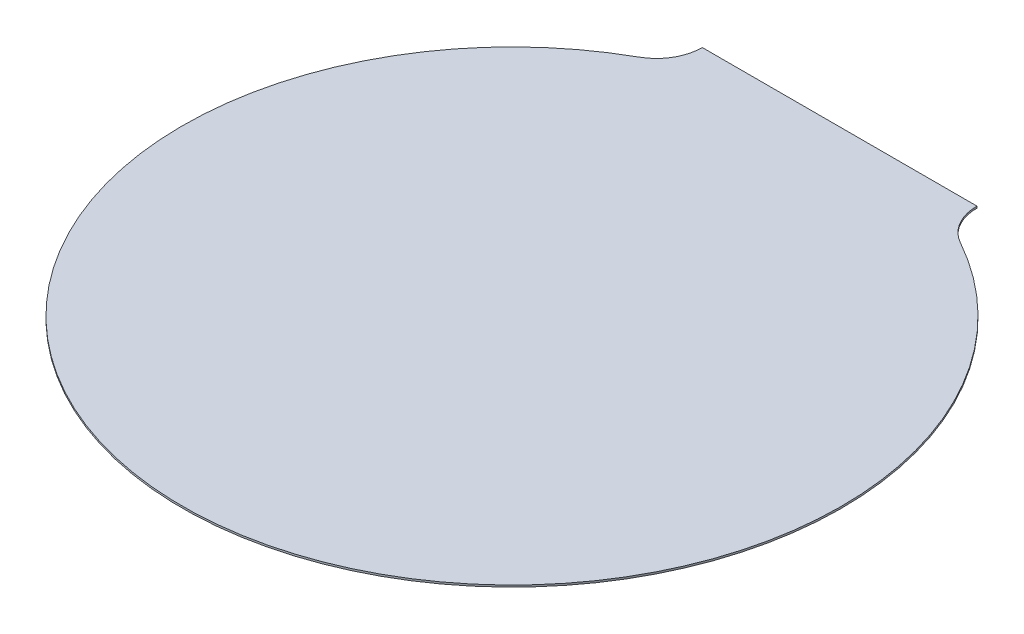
ISO-10303-21;
HEADER;
FILE_DESCRIPTION(('STEP AP214'),'2;1');
FILE_NAME('part.step','',(''),(''),'','','');
FILE_SCHEMA(('AUTOMOTIVE_DESIGN { 1 0 10303 214 1 1 1 1 }'));
ENDSEC;
DATA;
#1=APPLICATION_CONTEXT('core data for automotive mechanical design processes');
#2=APPLICATION_PROTOCOL_DEFINITION('international standard','automotive_design',2000,#1);
#3=PRODUCT_CONTEXT('',#1,'mechanical');
#4=PRODUCT('Part','Part','',(#3));
#5=PRODUCT_RELATED_PRODUCT_CATEGORY('part','',(#4));
#6=PRODUCT_DEFINITION_FORMATION('','',#4);
#7=PRODUCT_DEFINITION_CONTEXT('part definition',#1,'design');
#8=PRODUCT_DEFINITION('design','',#6,#7);
#9=PRODUCT_DEFINITION_SHAPE('','',#8);
#10=(LENGTH_UNIT() NAMED_UNIT(*) SI_UNIT(.MILLI.,.METRE.));
#11=(NAMED_UNIT(*) PLANE_ANGLE_UNIT() SI_UNIT($,.RADIAN.));
#12=(NAMED_UNIT(*) SI_UNIT($,.STERADIAN.) SOLID_ANGLE_UNIT());
#13=UNCERTAINTY_MEASURE_WITH_UNIT(LENGTH_MEASURE(1.E-05),#10,'distance_accuracy_value','');
#14=(GEOMETRIC_REPRESENTATION_CONTEXT(3) GLOBAL_UNCERTAINTY_ASSIGNED_CONTEXT((#13)) GLOBAL_UNIT_ASSIGNED_CONTEXT((#10,
#11,#12)) REPRESENTATION_CONTEXT('',''));
#15=CARTESIAN_POINT('',(0.,0.,0.));
#16=DIRECTION('',(0.,0.,1.));
#17=DIRECTION('',(1.,0.,0.));
#18=AXIS2_PLACEMENT_3D('',#15,#16,#17);
#19=CARTESIAN_POINT('',(-5.07969240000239,0.0508,-9.09110120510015));
#20=DIRECTION('',(0.,-1.,0.));
#21=DIRECTION('',(0.,0.,-1.));
#22=AXIS2_PLACEMENT_3D('',#19,#20,#21);
#23=CYLINDRICAL_SURFACE('',#22,1.27000000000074);
#24=CARTESIAN_POINT('',(-5.07969240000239,0.,-9.09110120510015));
#25=DIRECTION('',(0.,-1.,0.));
#26=DIRECTION('',(0.,0.,1.));
#27=AXIS2_PLACEMENT_3D('',#24,#25,#26);
#28=CIRCLE('',#27,1.27000000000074);
#29=CARTESIAN_POINT('',(-3.80969240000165,0.,-9.09110120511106));
#30=VERTEX_POINT('',#29);
#31=CARTESIAN_POINT('',(-4.46021771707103,0.,-7.98243032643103));
#32=VERTEX_POINT('',#31);
#33=EDGE_CURVE('E93',#30,#32,#28,.T.);
#34=ORIENTED_EDGE('',*,*,#33,.T.);
#35=DIRECTION('',(0.,-1.,0.));
#36=VECTOR('',#35,1.);
#37=CARTESIAN_POINT('',(-4.46021771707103,0.0508,-7.98243032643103));
#38=LINE('',#37,#36);
#39=CARTESIAN_POINT('',(-4.46021771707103,0.0508,-7.98243032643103));
#40=VERTEX_POINT('',#39);
#41=EDGE_CURVE('E11',#40,#32,#38,.T.);
#42=ORIENTED_EDGE('',*,*,#41,.F.);
#43=CARTESIAN_POINT('',(-5.07969240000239,0.0508,-9.09110120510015));
#44=DIRECTION('',(0.,-1.,0.));
#45=DIRECTION('',(0.,0.,1.));
#46=AXIS2_PLACEMENT_3D('',#43,#44,#45);
#47=CIRCLE('',#46,1.27000000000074);
#48=CARTESIAN_POINT('',(-3.80969240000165,0.0508,-9.09110120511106));
#49=VERTEX_POINT('',#48);
#50=EDGE_CURVE('E81',#49,#40,#47,.T.);
#51=ORIENTED_EDGE('',*,*,#50,.F.);
#52=DIRECTION('',(0.,-1.,0.));
#53=VECTOR('',#52,1.);
#54=CARTESIAN_POINT('',(-3.80969240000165,0.0508,-9.09110120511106));
#55=LINE('',#54,#53);
#56=EDGE_CURVE('E89',#49,#30,#55,.T.);
#57=ORIENTED_EDGE('',*,*,#56,.T.);
#58=EDGE_LOOP('',(#34,#42,#51,#57));
#59=FACE_BOUND('',#58,.T.);
#60=ADVANCED_FACE('F30',(#59),#23,.F.);
#61=CARTESIAN_POINT('',(0.,0.0508,0.));
#62=DIRECTION('',(0.,-1.,0.));
#63=DIRECTION('',(0.,0.,-1.));
#64=AXIS2_PLACEMENT_3D('',#61,#62,#63);
#65=CYLINDRICAL_SURFACE('',#64,9.14400000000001);
#66=CARTESIAN_POINT('',(0.,0.,0.));
#67=DIRECTION('',(0.,1.,0.));
#68=DIRECTION('',(0.,0.,1.));
#69=AXIS2_PLACEMENT_3D('',#66,#67,#68);
#70=CIRCLE('',#69,9.14400000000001);
#71=CARTESIAN_POINT('',(4.4602177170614,0.,-7.98243032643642));
#72=VERTEX_POINT('',#71);
#73=EDGE_CURVE('E85',#32,#72,#70,.T.);
#74=ORIENTED_EDGE('',*,*,#73,.T.);
#75=DIRECTION('',(0.,-1.,0.));
#76=VECTOR('',#75,1.);
#77=CARTESIAN_POINT('',(4.4602177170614,0.0508,-7.98243032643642));
#78=LINE('',#77,#76);
#79=CARTESIAN_POINT('',(4.4602177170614,0.0508,-7.98243032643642));
#80=VERTEX_POINT('',#79);
#81=EDGE_CURVE('E38',#80,#72,#78,.T.);
#82=ORIENTED_EDGE('',*,*,#81,.F.);
#83=CARTESIAN_POINT('',(0.,0.0508,0.));
#84=DIRECTION('',(0.,1.,0.));
#85=DIRECTION('',(0.,0.,1.));
#86=AXIS2_PLACEMENT_3D('',#83,#84,#85);
#87=CIRCLE('',#86,9.14400000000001);
#88=EDGE_CURVE('E76',#40,#80,#87,.T.);
#89=ORIENTED_EDGE('',*,*,#88,.F.);
#90=ORIENTED_EDGE('',*,*,#41,.T.);
#91=EDGE_LOOP('',(#74,#82,#89,#90));
#92=FACE_BOUND('',#91,.T.);
#93=ADVANCED_FACE('F84',(#92),#65,.T.);
#94=CARTESIAN_POINT('',(5.07969239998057,0.0508,-9.09110120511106));
#95=DIRECTION('',(0.,-1.,0.));
#96=DIRECTION('',(0.,0.,-1.));
#97=AXIS2_PLACEMENT_3D('',#94,#95,#96);
#98=CYLINDRICAL_SURFACE('',#97,1.26999999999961);
#99=CARTESIAN_POINT('',(5.07969239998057,0.,-9.09110120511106));
#100=DIRECTION('',(0.,-1.,0.));
#101=DIRECTION('',(0.,0.,1.));
#102=AXIS2_PLACEMENT_3D('',#99,#100,#101);
#103=CIRCLE('',#102,1.26999999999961);
#104=CARTESIAN_POINT('',(3.80969239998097,0.,-9.09110120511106));
#105=VERTEX_POINT('',#104);
#106=EDGE_CURVE('E63',#72,#105,#103,.T.);
#107=ORIENTED_EDGE('',*,*,#106,.T.);
#108=DIRECTION('',(0.,-1.,0.));
#109=VECTOR('',#108,1.);
#110=CARTESIAN_POINT('',(3.80969239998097,0.0508,-9.09110120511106));
#111=LINE('',#110,#109);
#112=CARTESIAN_POINT('',(3.80969239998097,0.0508,-9.09110120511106));
#113=VERTEX_POINT('',#112);
#114=EDGE_CURVE('E86',#113,#105,#111,.T.);
#115=ORIENTED_EDGE('',*,*,#114,.F.);
#116=CARTESIAN_POINT('',(5.07969239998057,0.0508,-9.09110120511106));
#117=DIRECTION('',(0.,-1.,0.));
#118=DIRECTION('',(0.,0.,1.));
#119=AXIS2_PLACEMENT_3D('',#116,#117,#118);
#120=CIRCLE('',#119,1.26999999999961);
#121=EDGE_CURVE('E79',#80,#113,#120,.T.);
#122=ORIENTED_EDGE('',*,*,#121,.F.);
#123=ORIENTED_EDGE('',*,*,#81,.T.);
#124=EDGE_LOOP('',(#107,#115,#122,#123));
#125=FACE_BOUND('',#124,.T.);
#126=ADVANCED_FACE('F87',(#125),#98,.F.);
#127=CARTESIAN_POINT('',(3.80969239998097,0.0508,-9.09110120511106));
#128=DIRECTION('',(0.,0.,1.));
#129=DIRECTION('',(1.,0.,0.));
#130=AXIS2_PLACEMENT_3D('',#127,#128,#129);
#131=PLANE('',#130);
#132=DIRECTION('',(-1.,0.,0.));
#133=VECTOR('',#132,1.);
#134=CARTESIAN_POINT('',(3.80969239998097,0.,-9.09110120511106));
#135=LINE('',#134,#133);
#136=EDGE_CURVE('E69',#105,#30,#135,.T.);
#137=ORIENTED_EDGE('',*,*,#136,.T.);
#138=ORIENTED_EDGE('',*,*,#56,.F.);
#139=DIRECTION('',(-1.,0.,0.));
#140=VECTOR('',#139,1.);
#141=CARTESIAN_POINT('',(3.80969239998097,0.0508,-9.09110120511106));
#142=LINE('',#141,#140);
#143=EDGE_CURVE('E46',#113,#49,#142,.T.);
#144=ORIENTED_EDGE('',*,*,#143,.F.);
#145=ORIENTED_EDGE('',*,*,#114,.T.);
#146=EDGE_LOOP('',(#137,#138,#144,#145));
#147=FACE_BOUND('',#146,.T.);
#148=ADVANCED_FACE('F100',(#147),#131,.F.);
#149=CARTESIAN_POINT('',(-5.07969240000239,0.0508,-9.09110120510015));
#150=DIRECTION('',(0.,1.,0.));
#151=DIRECTION('',(0.,0.,1.));
#152=AXIS2_PLACEMENT_3D('',#149,#150,#151);
#153=PLANE('',#152);
#154=ORIENTED_EDGE('',*,*,#50,.T.);
#155=ORIENTED_EDGE('',*,*,#88,.T.);
#156=ORIENTED_EDGE('',*,*,#121,.T.);
#157=ORIENTED_EDGE('',*,*,#143,.T.);
#158=EDGE_LOOP('',(#154,#155,#156,#157));
#159=FACE_BOUND('',#158,.T.);
#160=ADVANCED_FACE('F77',(#159),#153,.T.);
#161=CARTESIAN_POINT('',(-5.07969240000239,0.,-9.09110120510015));
#162=DIRECTION('',(0.,1.,0.));
#163=DIRECTION('',(0.,0.,1.));
#164=AXIS2_PLACEMENT_3D('',#161,#162,#163);
#165=PLANE('',#164);
#166=ORIENTED_EDGE('',*,*,#33,.F.);
#167=ORIENTED_EDGE('',*,*,#136,.F.);
#168=ORIENTED_EDGE('',*,*,#106,.F.);
#169=ORIENTED_EDGE('',*,*,#73,.F.);
#170=EDGE_LOOP('',(#166,#167,#168,#169));
#171=FACE_BOUND('',#170,.T.);
#172=ADVANCED_FACE('F103',(#171),#165,.F.);
#173=CLOSED_SHELL('',(#60,#93,#126,#148,#160,#172));
#174=MANIFOLD_SOLID_BREP('B2',#173);
#175=ADVANCED_BREP_SHAPE_REPRESENTATION('',(#18,#174),#14);
#176=SHAPE_DEFINITION_REPRESENTATION(#9,#175);
ENDSEC;
END-ISO-10303-21;
